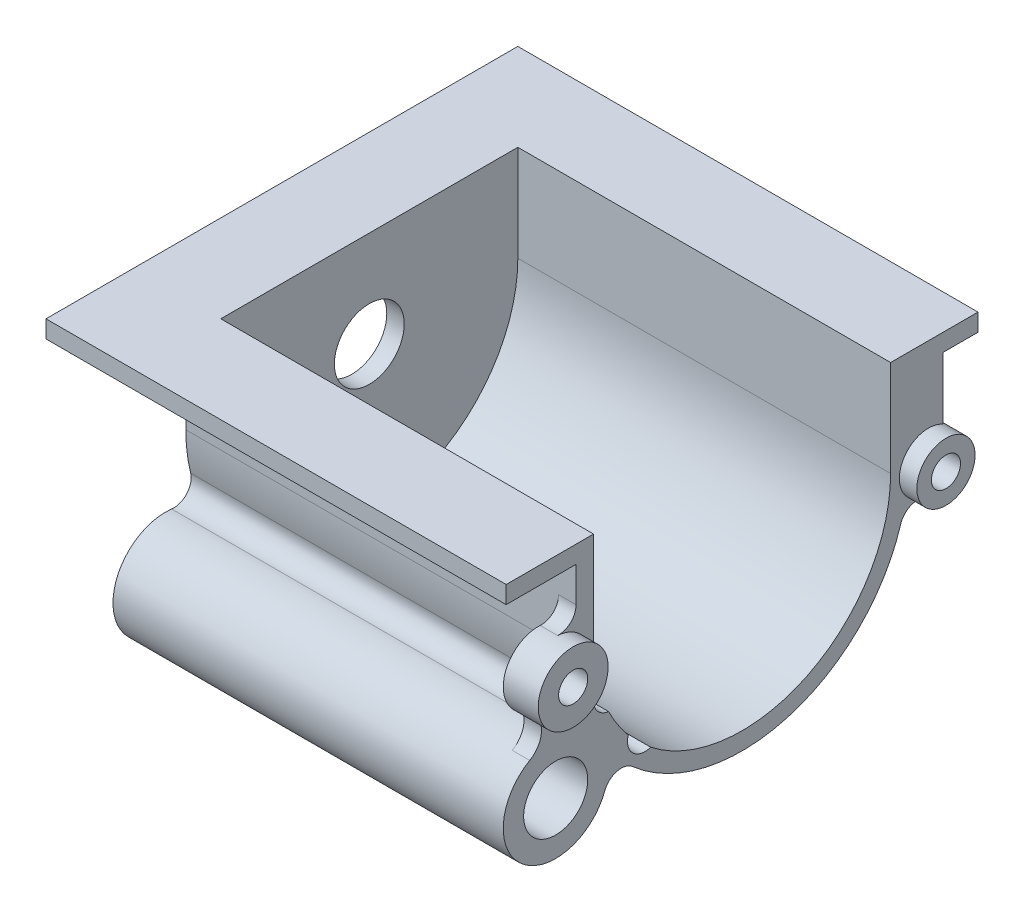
ISO-10303-21;
HEADER;
FILE_DESCRIPTION(('STEP AP214'),'2;1');
FILE_NAME('part.step','',(''),(''),'','','');
FILE_SCHEMA(('AUTOMOTIVE_DESIGN { 1 0 10303 214 1 1 1 1 }'));
ENDSEC;
DATA;
#1=APPLICATION_CONTEXT('core data for automotive mechanical design processes');
#2=APPLICATION_PROTOCOL_DEFINITION('international standard','automotive_design',2000,#1);
#3=PRODUCT_CONTEXT('',#1,'mechanical');
#4=PRODUCT('Part','Part','',(#3));
#5=PRODUCT_RELATED_PRODUCT_CATEGORY('part','',(#4));
#6=PRODUCT_DEFINITION_FORMATION('','',#4);
#7=PRODUCT_DEFINITION_CONTEXT('part definition',#1,'design');
#8=PRODUCT_DEFINITION('design','',#6,#7);
#9=PRODUCT_DEFINITION_SHAPE('','',#8);
#10=(LENGTH_UNIT() NAMED_UNIT(*) SI_UNIT(.MILLI.,.METRE.));
#11=(NAMED_UNIT(*) PLANE_ANGLE_UNIT() SI_UNIT($,.RADIAN.));
#12=(NAMED_UNIT(*) SI_UNIT($,.STERADIAN.) SOLID_ANGLE_UNIT());
#13=UNCERTAINTY_MEASURE_WITH_UNIT(LENGTH_MEASURE(1.E-05),#10,'distance_accuracy_value','');
#14=(GEOMETRIC_REPRESENTATION_CONTEXT(3) GLOBAL_UNCERTAINTY_ASSIGNED_CONTEXT((#13)) GLOBAL_UNIT_ASSIGNED_CONTEXT((#10,
#11,#12)) REPRESENTATION_CONTEXT('',''));
#15=CARTESIAN_POINT('',(0.,0.,0.));
#16=DIRECTION('',(0.,0.,1.));
#17=DIRECTION('',(1.,0.,0.));
#18=AXIS2_PLACEMENT_3D('',#15,#16,#17);
#19=CARTESIAN_POINT('',(67.,0.,0.));
#20=DIRECTION('',(-1.,0.,0.));
#21=DIRECTION('',(0.,0.,1.));
#22=AXIS2_PLACEMENT_3D('',#19,#20,#21);
#23=CYLINDRICAL_SURFACE('',#22,25.5);
#24=DIRECTION('',(1.,0.,0.));
#25=VECTOR('',#24,1.);
#26=CARTESIAN_POINT('',(35.,-16.3842544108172,19.5398620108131));
#27=LINE('',#26,#25);
#28=CARTESIAN_POINT('',(3.,-16.3842544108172,19.5398620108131));
#29=VERTEX_POINT('',#28);
#30=CARTESIAN_POINT('',(67.,-16.3842544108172,19.5398620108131));
#31=VERTEX_POINT('',#30);
#32=EDGE_CURVE('E213',#29,#31,#27,.T.);
#33=ORIENTED_EDGE('',*,*,#32,.F.);
#34=CARTESIAN_POINT('',(3.,0.,0.));
#35=DIRECTION('',(-1.,0.,0.));
#36=DIRECTION('',(0.,0.,1.));
#37=AXIS2_PLACEMENT_3D('',#34,#35,#36);
#38=CIRCLE('',#37,25.5);
#39=CARTESIAN_POINT('',(3.,-11.1864755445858,22.9153390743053));
#40=VERTEX_POINT('',#39);
#41=EDGE_CURVE('E394',#40,#29,#38,.F.);
#42=ORIENTED_EDGE('',*,*,#41,.F.);
#43=DIRECTION('',(1.,0.,0.));
#44=VECTOR('',#43,1.);
#45=CARTESIAN_POINT('',(35.,-11.1864755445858,22.9153390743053));
#46=LINE('',#45,#44);
#47=CARTESIAN_POINT('',(67.,-11.1864755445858,22.9153390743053));
#48=VERTEX_POINT('',#47);
#49=EDGE_CURVE('E232',#48,#40,#46,.F.);
#50=ORIENTED_EDGE('',*,*,#49,.F.);
#51=CARTESIAN_POINT('',(67.,0.,0.));
#52=DIRECTION('',(-1.,0.,0.));
#53=DIRECTION('',(0.,0.,1.));
#54=AXIS2_PLACEMENT_3D('',#51,#52,#53);
#55=CIRCLE('',#54,25.5);
#56=EDGE_CURVE('E227',#48,#31,#55,.F.);
#57=ORIENTED_EDGE('',*,*,#56,.T.);
#58=EDGE_LOOP('',(#33,#42,#50,#57));
#59=FACE_BOUND('',#58,.T.);
#60=ADVANCED_FACE('F28',(#59),#23,.F.);
#61=DIRECTION('',(1.,0.,0.));
#62=VECTOR('',#61,1.);
#63=CARTESIAN_POINT('',(35.,-6.1603585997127,24.7446960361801));
#64=LINE('',#63,#62);
#65=CARTESIAN_POINT('',(3.,-6.1603585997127,24.7446960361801));
#66=VERTEX_POINT('',#65);
#67=CARTESIAN_POINT('',(67.,-6.16035859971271,24.7446960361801));
#68=VERTEX_POINT('',#67);
#69=EDGE_CURVE('E420',#66,#68,#64,.T.);
#70=ORIENTED_EDGE('',*,*,#69,.F.);
#71=CARTESIAN_POINT('',(3.,0.,25.5));
#72=VERTEX_POINT('',#71);
#73=EDGE_CURVE('E391',#72,#66,#38,.F.);
#74=ORIENTED_EDGE('',*,*,#73,.F.);
#75=DIRECTION('',(-1.,0.,0.));
#76=VECTOR('',#75,1.);
#77=CARTESIAN_POINT('',(67.,0.,25.5));
#78=LINE('',#77,#76);
#79=CARTESIAN_POINT('',(67.,0.,25.5));
#80=VERTEX_POINT('',#79);
#81=EDGE_CURVE('E253',#80,#72,#78,.T.);
#82=ORIENTED_EDGE('',*,*,#81,.F.);
#83=EDGE_CURVE('E233',#80,#68,#55,.F.);
#84=ORIENTED_EDGE('',*,*,#83,.T.);
#85=EDGE_LOOP('',(#70,#74,#82,#84));
#86=FACE_BOUND('',#85,.T.);
#87=ADVANCED_FACE('F418',(#86),#23,.F.);
#88=CARTESIAN_POINT('',(67.,0.,0.));
#89=DIRECTION('',(-1.,0.,0.));
#90=DIRECTION('',(0.,0.,1.));
#91=AXIS2_PLACEMENT_3D('',#88,#89,#90);
#92=CYLINDRICAL_SURFACE('',#91,28.5);
#93=DIRECTION('',(-1.,0.,0.));
#94=VECTOR('',#93,1.);
#95=CARTESIAN_POINT('',(67.,-21.4374447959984,18.779935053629));
#96=LINE('',#95,#94);
#97=CARTESIAN_POINT('',(67.,-21.4374447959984,18.779935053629));
#98=VERTEX_POINT('',#97);
#99=CARTESIAN_POINT('',(0.,-21.4374447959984,18.779935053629));
#100=VERTEX_POINT('',#99);
#101=EDGE_CURVE('E290',#98,#100,#96,.T.);
#102=ORIENTED_EDGE('',*,*,#101,.T.);
#103=CARTESIAN_POINT('',(0.,0.,0.));
#104=DIRECTION('',(1.,0.,0.));
#105=DIRECTION('',(0.,0.,1.));
#106=AXIS2_PLACEMENT_3D('',#103,#104,#105);
#107=CIRCLE('',#106,28.5);
#108=CARTESIAN_POINT('',(0.,0.,-28.5));
#109=VERTEX_POINT('',#108);
#110=EDGE_CURVE('E258',#100,#109,#107,.T.);
#111=ORIENTED_EDGE('',*,*,#110,.T.);
#112=DIRECTION('',(-1.,0.,0.));
#113=VECTOR('',#112,1.);
#114=CARTESIAN_POINT('',(67.,0.,-28.5));
#115=LINE('',#114,#113);
#116=CARTESIAN_POINT('',(64.,0.,-28.5));
#117=VERTEX_POINT('',#116);
#118=EDGE_CURVE('E276',#117,#109,#115,.T.);
#119=ORIENTED_EDGE('',*,*,#118,.F.);
#120=CARTESIAN_POINT('',(64.,0.,0.));
#121=DIRECTION('',(1.,0.,0.));
#122=DIRECTION('',(0.,0.,-1.));
#123=AXIS2_PLACEMENT_3D('',#120,#121,#122);
#124=CIRCLE('',#123,28.5);
#125=CARTESIAN_POINT('',(64.,-8.38911689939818,-27.2373405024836));
#126=VERTEX_POINT('',#125);
#127=EDGE_CURVE('E319',#126,#117,#124,.T.);
#128=ORIENTED_EDGE('',*,*,#127,.F.);
#129=DIRECTION('',(-1.,0.,0.));
#130=VECTOR('',#129,1.);
#131=CARTESIAN_POINT('',(67.,-8.38911689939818,-27.2373405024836));
#132=LINE('',#131,#130);
#133=CARTESIAN_POINT('',(67.,-8.38911689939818,-27.2373405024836));
#134=VERTEX_POINT('',#133);
#135=EDGE_CURVE('E287',#126,#134,#132,.F.);
#136=ORIENTED_EDGE('',*,*,#135,.T.);
#137=CARTESIAN_POINT('',(67.,0.,0.));
#138=DIRECTION('',(1.,0.,0.));
#139=DIRECTION('',(0.,0.,1.));
#140=AXIS2_PLACEMENT_3D('',#137,#138,#139);
#141=CIRCLE('',#140,28.5);
#142=EDGE_CURVE('E264',#98,#134,#141,.T.);
#143=ORIENTED_EDGE('',*,*,#142,.F.);
#144=EDGE_LOOP('',(#102,#111,#119,#128,#136,#143));
#145=FACE_BOUND('',#144,.T.);
#146=ADVANCED_FACE('F480',(#145),#92,.T.);
#147=CARTESIAN_POINT('',(64.,0.,0.));
#148=DIRECTION('',(1.,0.,0.));
#149=DIRECTION('',(0.,0.,-1.));
#150=AXIS2_PLACEMENT_3D('',#147,#148,#149);
#151=PLANE('',#150);
#152=CARTESIAN_POINT('',(64.,-1.5,32.));
#153=DIRECTION('',(1.,0.,0.));
#154=DIRECTION('',(0.,0.,-1.));
#155=AXIS2_PLACEMENT_3D('',#152,#153,#154);
#156=CIRCLE('',#155,2.49999999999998);
#157=CARTESIAN_POINT('',(64.,-1.5,29.5));
#158=VERTEX_POINT('',#157);
#159=EDGE_CURVE('E499',#158,#158,#156,.T.);
#160=ORIENTED_EDGE('',*,*,#159,.T.);
#161=EDGE_LOOP('',(#160));
#162=FACE_BOUND('',#161,.T.);
#163=CARTESIAN_POINT('',(64.,-19.5,32.));
#164=DIRECTION('',(-1.,0.,0.));
#165=DIRECTION('',(0.,0.,1.));
#166=AXIS2_PLACEMENT_3D('',#163,#164,#165);
#167=CIRCLE('',#166,9.);
#168=CARTESIAN_POINT('',(64.,-11.682796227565,36.4599691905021));
#169=VERTEX_POINT('',#168);
#170=CARTESIAN_POINT('',(64.,-10.5638509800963,30.9298408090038));
#171=VERTEX_POINT('',#170);
#172=EDGE_CURVE('E428',#169,#171,#167,.T.);
#173=ORIENTED_EDGE('',*,*,#172,.F.);
#174=CARTESIAN_POINT('',(64.,-8.20848343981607,38.4421777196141));
#175=DIRECTION('',(-1.,0.,0.));
#176=DIRECTION('',(0.,0.,-1.));
#177=AXIS2_PLACEMENT_3D('',#174,#175,#176);
#178=CIRCLE('',#177,4.);
#179=CARTESIAN_POINT('',(64.,-6.8721953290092,34.6719875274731));
#180=VERTEX_POINT('',#179);
#181=EDGE_CURVE('E342',#180,#169,#178,.T.);
#182=ORIENTED_EDGE('',*,*,#181,.F.);
#183=CARTESIAN_POINT('',(64.,-1.5,32.));
#184=DIRECTION('',(1.,0.,0.));
#185=DIRECTION('',(0.,0.,-1.));
#186=AXIS2_PLACEMENT_3D('',#183,#184,#185);
#187=CIRCLE('',#186,6.);
#188=CARTESIAN_POINT('',(64.,4.49073358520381,31.6666666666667));
#189=VERTEX_POINT('',#188);
#190=EDGE_CURVE('E340',#189,#180,#187,.T.);
#191=ORIENTED_EDGE('',*,*,#190,.F.);
#192=CARTESIAN_POINT('',(64.,7.48610037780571,31.5));
#193=DIRECTION('',(1.,0.,0.));
#194=DIRECTION('',(0.,0.,-1.));
#195=AXIS2_PLACEMENT_3D('',#192,#193,#194);
#196=CIRCLE('',#195,3.);
#197=CARTESIAN_POINT('',(64.,7.48610037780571,28.5));
#198=VERTEX_POINT('',#197);
#199=EDGE_CURVE('E295',#189,#198,#196,.T.);
#200=ORIENTED_EDGE('',*,*,#199,.T.);
#201=DIRECTION('',(0.,1.,0.));
#202=VECTOR('',#201,1.);
#203=CARTESIAN_POINT('',(64.,3.37339717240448,28.5));
#204=LINE('',#203,#202);
#205=CARTESIAN_POINT('',(64.,0.,28.5));
#206=VERTEX_POINT('',#205);
#207=EDGE_CURVE('E338',#206,#198,#204,.T.);
#208=ORIENTED_EDGE('',*,*,#207,.F.);
#209=CARTESIAN_POINT('',(64.,0.,0.));
#210=DIRECTION('',(-1.,0.,0.));
#211=DIRECTION('',(0.,0.,-1.));
#212=AXIS2_PLACEMENT_3D('',#209,#210,#211);
#213=CIRCLE('',#212,28.5);
#214=CARTESIAN_POINT('',(64.,-6.86274086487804,27.6613952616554));
#215=VERTEX_POINT('',#214);
#216=EDGE_CURVE('E336',#215,#206,#213,.T.);
#217=ORIENTED_EDGE('',*,*,#216,.F.);
#218=CARTESIAN_POINT('',(64.,-7.58513464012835,30.5731210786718));
#219=DIRECTION('',(1.,0.,0.));
#220=DIRECTION('',(0.,0.,-1.));
#221=AXIS2_PLACEMENT_3D('',#218,#219,#220);
#222=CIRCLE('',#221,3.00000000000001);
#223=EDGE_CURVE('E429',#171,#215,#222,.T.);
#224=ORIENTED_EDGE('',*,*,#223,.F.);
#225=EDGE_LOOP('',(#173,#182,#191,#200,#208,#217,#224));
#226=FACE_BOUND('',#225,.T.);
#227=ADVANCED_FACE('F537',(#162,#226),#151,.F.);
#228=CARTESIAN_POINT('',(67.,0.,0.));
#229=DIRECTION('',(-1.,0.,0.));
#230=DIRECTION('',(0.,0.,1.));
#231=AXIS2_PLACEMENT_3D('',#228,#229,#230);
#232=PLANE('',#231);
#233=CARTESIAN_POINT('',(67.,-19.5,32.));
#234=DIRECTION('',(1.,0.,0.));
#235=DIRECTION('',(0.,0.,-1.));
#236=AXIS2_PLACEMENT_3D('',#233,#234,#235);
#237=CIRCLE('',#236,5.49999999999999);
#238=CARTESIAN_POINT('',(67.,-19.5,26.5));
#239=VERTEX_POINT('',#238);
#240=EDGE_CURVE('E505',#239,#239,#237,.T.);
#241=ORIENTED_EDGE('',*,*,#240,.F.);
#242=EDGE_LOOP('',(#241));
#243=FACE_BOUND('',#242,.T.);
#244=CARTESIAN_POINT('',(67.,-20.0997610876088,15.6923422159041));
#245=VERTEX_POINT('',#244);
#246=CARTESIAN_POINT('',(67.,0.,-25.5));
#247=VERTEX_POINT('',#246);
#248=EDGE_CURVE('E229',#245,#247,#55,.F.);
#249=ORIENTED_EDGE('',*,*,#248,.F.);
#250=CARTESIAN_POINT('',(67.,-17.2641552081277,16.6718008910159));
#251=DIRECTION('',(1.,0.,0.));
#252=DIRECTION('',(0.,0.,-1.));
#253=AXIS2_PLACEMENT_3D('',#250,#251,#252);
#254=CIRCLE('',#253,3.);
#255=EDGE_CURVE('E45',#31,#245,#254,.T.);
#256=ORIENTED_EDGE('',*,*,#255,.F.);
#257=ORIENTED_EDGE('',*,*,#56,.F.);
#258=CARTESIAN_POINT('',(67.,-8.20848343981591,22.5526228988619));
#259=DIRECTION('',(1.,0.,0.));
#260=DIRECTION('',(0.,0.,-1.));
#261=AXIS2_PLACEMENT_3D('',#258,#259,#260);
#262=CIRCLE('',#261,3.);
#263=EDGE_CURVE('E53',#68,#48,#262,.T.);
#264=ORIENTED_EDGE('',*,*,#263,.F.);
#265=ORIENTED_EDGE('',*,*,#83,.F.);
#266=DIRECTION('',(0.,-1.,0.));
#267=VECTOR('',#266,1.);
#268=CARTESIAN_POINT('',(67.,0.,25.5));
#269=LINE('',#268,#267);
#270=CARTESIAN_POINT('',(67.,16.5,25.5));
#271=VERTEX_POINT('',#270);
#272=EDGE_CURVE('E242',#271,#80,#269,.T.);
#273=ORIENTED_EDGE('',*,*,#272,.F.);
#274=DIRECTION('',(0.,0.,1.));
#275=VECTOR('',#274,1.);
#276=CARTESIAN_POINT('',(67.,16.5,28.5));
#277=LINE('',#276,#275);
#278=CARTESIAN_POINT('',(67.,16.5,40.5));
#279=VERTEX_POINT('',#278);
#280=EDGE_CURVE('E267',#271,#279,#277,.T.);
#281=ORIENTED_EDGE('',*,*,#280,.T.);
#282=DIRECTION('',(0.,1.,0.));
#283=VECTOR('',#282,1.);
#284=CARTESIAN_POINT('',(67.,13.5,40.5));
#285=LINE('',#284,#283);
#286=CARTESIAN_POINT('',(67.,13.5,40.5));
#287=VERTEX_POINT('',#286);
#288=EDGE_CURVE('E374',#287,#279,#285,.T.);
#289=ORIENTED_EDGE('',*,*,#288,.F.);
#290=DIRECTION('',(0.,0.,-1.));
#291=VECTOR('',#290,1.);
#292=CARTESIAN_POINT('',(67.,13.5,25.5));
#293=LINE('',#292,#291);
#294=CARTESIAN_POINT('',(67.,13.5,28.5));
#295=VERTEX_POINT('',#294);
#296=EDGE_CURVE('E370',#287,#295,#293,.T.);
#297=ORIENTED_EDGE('',*,*,#296,.T.);
#298=DIRECTION('',(0.,-1.,0.));
#299=VECTOR('',#298,1.);
#300=CARTESIAN_POINT('',(67.,0.,28.5));
#301=LINE('',#300,#299);
#302=CARTESIAN_POINT('',(67.,7.48610037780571,28.5));
#303=VERTEX_POINT('',#302);
#304=EDGE_CURVE('E271',#295,#303,#301,.T.);
#305=ORIENTED_EDGE('',*,*,#304,.T.);
#306=CARTESIAN_POINT('',(67.,7.48610037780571,31.5));
#307=DIRECTION('',(-1.,0.,0.));
#308=DIRECTION('',(0.,0.,1.));
#309=AXIS2_PLACEMENT_3D('',#306,#307,#308);
#310=CIRCLE('',#309,3.);
#311=CARTESIAN_POINT('',(67.,4.49073358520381,31.6666666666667));
#312=VERTEX_POINT('',#311);
#313=EDGE_CURVE('E293',#303,#312,#310,.T.);
#314=ORIENTED_EDGE('',*,*,#313,.T.);
#315=CARTESIAN_POINT('',(67.,-1.5,32.));
#316=DIRECTION('',(1.,0.,0.));
#317=DIRECTION('',(0.,0.,-1.));
#318=AXIS2_PLACEMENT_3D('',#315,#316,#317);
#319=CIRCLE('',#318,5.99999999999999);
#320=CARTESIAN_POINT('',(67.,-6.8721953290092,34.6719875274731));
#321=VERTEX_POINT('',#320);
#322=EDGE_CURVE('E439',#321,#312,#319,.T.);
#323=ORIENTED_EDGE('',*,*,#322,.F.);
#324=CARTESIAN_POINT('',(67.,-8.20848343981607,38.4421777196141));
#325=DIRECTION('',(-1.,0.,0.));
#326=DIRECTION('',(0.,0.,-1.));
#327=AXIS2_PLACEMENT_3D('',#324,#325,#326);
#328=CIRCLE('',#327,4.);
#329=CARTESIAN_POINT('',(67.,-11.682796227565,36.4599691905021));
#330=VERTEX_POINT('',#329);
#331=EDGE_CURVE('E330',#321,#330,#328,.T.);
#332=ORIENTED_EDGE('',*,*,#331,.T.);
#333=CARTESIAN_POINT('',(67.,-19.5,32.));
#334=DIRECTION('',(1.,0.,0.));
#335=DIRECTION('',(0.,0.,-1.));
#336=AXIS2_PLACEMENT_3D('',#333,#334,#335);
#337=CIRCLE('',#336,9.);
#338=CARTESIAN_POINT('',(67.,-22.6455134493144,23.567577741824));
#339=VERTEX_POINT('',#338);
#340=EDGE_CURVE('E333',#330,#339,#337,.T.);
#341=ORIENTED_EDGE('',*,*,#340,.T.);
#342=CARTESIAN_POINT('',(67.,-23.6940179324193,20.756770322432));
#343=DIRECTION('',(-1.,0.,0.));
#344=DIRECTION('',(0.,0.,1.));
#345=AXIS2_PLACEMENT_3D('',#342,#343,#344);
#346=CIRCLE('',#345,3.);
#347=EDGE_CURVE('E298',#339,#98,#346,.T.);
#348=ORIENTED_EDGE('',*,*,#347,.T.);
#349=ORIENTED_EDGE('',*,*,#142,.T.);
#350=CARTESIAN_POINT('',(67.,-9.27218183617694,-30.1044289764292));
#351=DIRECTION('',(-1.,0.,0.));
#352=DIRECTION('',(0.,0.,1.));
#353=AXIS2_PLACEMENT_3D('',#350,#351,#352);
#354=CIRCLE('',#353,3.);
#355=CARTESIAN_POINT('',(67.,-6.35761364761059,-30.8152681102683));
#356=VERTEX_POINT('',#355);
#357=EDGE_CURVE('E37',#134,#356,#354,.T.);
#358=ORIENTED_EDGE('',*,*,#357,.T.);
#359=CARTESIAN_POINT('',(67.,-1.5,-32.));
#360=DIRECTION('',(1.,0.,0.));
#361=DIRECTION('',(0.,0.,-1.));
#362=AXIS2_PLACEMENT_3D('',#359,#360,#361);
#363=CIRCLE('',#362,5.);
#364=CARTESIAN_POINT('',(67.,2.83012701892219,-34.5));
#365=VERTEX_POINT('',#364);
#366=EDGE_CURVE('E305',#365,#356,#363,.T.);
#367=ORIENTED_EDGE('',*,*,#366,.F.);
#368=DIRECTION('',(0.,1.,0.));
#369=VECTOR('',#368,1.);
#370=CARTESIAN_POINT('',(67.,2.83012701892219,-34.5));
#371=LINE('',#370,#369);
#372=CARTESIAN_POINT('',(67.,13.5,-34.5));
#373=VERTEX_POINT('',#372);
#374=EDGE_CURVE('E302',#365,#373,#371,.T.);
#375=ORIENTED_EDGE('',*,*,#374,.T.);
#376=DIRECTION('',(0.,0.,-1.));
#377=VECTOR('',#376,1.);
#378=CARTESIAN_POINT('',(67.,13.5,-25.5));
#379=LINE('',#378,#377);
#380=CARTESIAN_POINT('',(67.,13.5,-40.5));
#381=VERTEX_POINT('',#380);
#382=EDGE_CURVE('E359',#373,#381,#379,.T.);
#383=ORIENTED_EDGE('',*,*,#382,.T.);
#384=DIRECTION('',(0.,1.,0.));
#385=VECTOR('',#384,1.);
#386=CARTESIAN_POINT('',(67.,13.5,-40.5));
#387=LINE('',#386,#385);
#388=CARTESIAN_POINT('',(67.,16.5,-40.5));
#389=VERTEX_POINT('',#388);
#390=EDGE_CURVE('E373',#381,#389,#387,.T.);
#391=ORIENTED_EDGE('',*,*,#390,.T.);
#392=CARTESIAN_POINT('',(67.,16.5,-25.5));
#393=VERTEX_POINT('',#392);
#394=EDGE_CURVE('E268',#389,#393,#277,.T.);
#395=ORIENTED_EDGE('',*,*,#394,.T.);
#396=DIRECTION('',(0.,1.,0.));
#397=VECTOR('',#396,1.);
#398=CARTESIAN_POINT('',(67.,0.,-25.5));
#399=LINE('',#398,#397);
#400=EDGE_CURVE('E236',#247,#393,#399,.T.);
#401=ORIENTED_EDGE('',*,*,#400,.F.);
#402=EDGE_LOOP('',(#249,#256,#257,#264,#265,#273,#281,#289,#297,#305,#314,#323,#332,#341,#348,
#349,#358,#367,#375,#383,#391,#395,#401));
#403=FACE_BOUND('',#402,.T.);
#404=ADVANCED_FACE('F226',(#243,#403),#232,.F.);
#405=CARTESIAN_POINT('',(67.,0.,-28.5));
#406=DIRECTION('',(0.,0.,1.));
#407=DIRECTION('',(1.,0.,0.));
#408=AXIS2_PLACEMENT_3D('',#405,#406,#407);
#409=PLANE('',#408);
#410=DIRECTION('',(0.,1.,0.));
#411=VECTOR('',#410,1.);
#412=CARTESIAN_POINT('',(64.,0.,-28.5));
#413=LINE('',#412,#411);
#414=CARTESIAN_POINT('',(64.,13.5,-28.5));
#415=VERTEX_POINT('',#414);
#416=EDGE_CURVE('E315',#117,#415,#413,.T.);
#417=ORIENTED_EDGE('',*,*,#416,.F.);
#418=ORIENTED_EDGE('',*,*,#118,.T.);
#419=DIRECTION('',(0.,1.,0.));
#420=VECTOR('',#419,1.);
#421=CARTESIAN_POINT('',(0.,0.,-28.5));
#422=LINE('',#421,#420);
#423=CARTESIAN_POINT('',(0.,13.5,-28.5));
#424=VERTEX_POINT('',#423);
#425=EDGE_CURVE('E257',#109,#424,#422,.T.);
#426=ORIENTED_EDGE('',*,*,#425,.T.);
#427=DIRECTION('',(-1.,0.,0.));
#428=VECTOR('',#427,1.);
#429=CARTESIAN_POINT('',(67.,13.5,-28.5));
#430=LINE('',#429,#428);
#431=EDGE_CURVE('E388',#415,#424,#430,.T.);
#432=ORIENTED_EDGE('',*,*,#431,.F.);
#433=EDGE_LOOP('',(#417,#418,#426,#432));
#434=FACE_BOUND('',#433,.T.);
#435=ADVANCED_FACE('F536',(#434),#409,.F.);
#436=CARTESIAN_POINT('',(67.,0.,28.5));
#437=DIRECTION('',(0.,0.,-1.));
#438=DIRECTION('',(-1.,0.,0.));
#439=AXIS2_PLACEMENT_3D('',#436,#437,#438);
#440=PLANE('',#439);
#441=ORIENTED_EDGE('',*,*,#207,.T.);
#442=DIRECTION('',(1.,0.,0.));
#443=VECTOR('',#442,1.);
#444=CARTESIAN_POINT('',(67.,7.48610037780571,28.5));
#445=LINE('',#444,#443);
#446=EDGE_CURVE('E279',#198,#303,#445,.T.);
#447=ORIENTED_EDGE('',*,*,#446,.T.);
#448=ORIENTED_EDGE('',*,*,#304,.F.);
#449=DIRECTION('',(1.,0.,0.));
#450=VECTOR('',#449,1.);
#451=CARTESIAN_POINT('',(67.,13.5,28.5));
#452=LINE('',#451,#450);
#453=CARTESIAN_POINT('',(0.,13.5,28.5));
#454=VERTEX_POINT('',#453);
#455=EDGE_CURVE('E386',#454,#295,#452,.T.);
#456=ORIENTED_EDGE('',*,*,#455,.F.);
#457=DIRECTION('',(0.,-1.,0.));
#458=VECTOR('',#457,1.);
#459=CARTESIAN_POINT('',(0.,0.,28.5));
#460=LINE('',#459,#458);
#461=CARTESIAN_POINT('',(0.,0.,28.5));
#462=VERTEX_POINT('',#461);
#463=EDGE_CURVE('E261',#454,#462,#460,.T.);
#464=ORIENTED_EDGE('',*,*,#463,.T.);
#465=DIRECTION('',(-1.,0.,0.));
#466=VECTOR('',#465,1.);
#467=CARTESIAN_POINT('',(67.,0.,28.5));
#468=LINE('',#467,#466);
#469=EDGE_CURVE('E274',#206,#462,#468,.T.);
#470=ORIENTED_EDGE('',*,*,#469,.F.);
#471=EDGE_LOOP('',(#441,#447,#448,#456,#464,#470));
#472=FACE_BOUND('',#471,.T.);
#473=ADVANCED_FACE('F532',(#472),#440,.F.);
#474=CARTESIAN_POINT('',(0.,0.,0.));
#475=DIRECTION('',(-1.,0.,0.));
#476=DIRECTION('',(0.,0.,1.));
#477=AXIS2_PLACEMENT_3D('',#474,#475,#476);
#478=PLANE('',#477);
#479=CARTESIAN_POINT('',(0.,0.,0.));
#480=DIRECTION('',(-1.,0.,0.));
#481=DIRECTION('',(0.,0.,1.));
#482=AXIS2_PLACEMENT_3D('',#479,#480,#481);
#483=CIRCLE('',#482,5.99999999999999);
#484=CARTESIAN_POINT('',(0.,0.,5.99999999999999));
#485=VERTEX_POINT('',#484);
#486=EDGE_CURVE('E508',#485,#485,#483,.T.);
#487=ORIENTED_EDGE('',*,*,#486,.F.);
#488=EDGE_LOOP('',(#487));
#489=FACE_BOUND('',#488,.T.);
#490=CARTESIAN_POINT('',(0.,-19.5,32.));
#491=DIRECTION('',(-1.,0.,0.));
#492=DIRECTION('',(0.,0.,1.));
#493=AXIS2_PLACEMENT_3D('',#490,#491,#492);
#494=CIRCLE('',#493,5.49999999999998);
#495=CARTESIAN_POINT('',(0.,-19.5,37.5));
#496=VERTEX_POINT('',#495);
#497=EDGE_CURVE('E32',#496,#496,#494,.T.);
#498=ORIENTED_EDGE('',*,*,#497,.F.);
#499=EDGE_LOOP('',(#498));
#500=FACE_BOUND('',#499,.T.);
#501=ORIENTED_EDGE('',*,*,#463,.F.);
#502=DIRECTION('',(0.,0.,-1.));
#503=VECTOR('',#502,1.);
#504=CARTESIAN_POINT('',(0.,13.5,0.));
#505=LINE('',#504,#503);
#506=EDGE_CURVE('E377',#454,#424,#505,.T.);
#507=ORIENTED_EDGE('',*,*,#506,.T.);
#508=ORIENTED_EDGE('',*,*,#425,.F.);
#509=ORIENTED_EDGE('',*,*,#110,.F.);
#510=CARTESIAN_POINT('',(0.,-23.6940179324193,20.756770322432));
#511=DIRECTION('',(-1.,0.,0.));
#512=DIRECTION('',(0.,0.,1.));
#513=AXIS2_PLACEMENT_3D('',#510,#511,#512);
#514=CIRCLE('',#513,3.);
#515=CARTESIAN_POINT('',(0.,-22.6455134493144,23.567577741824));
#516=VERTEX_POINT('',#515);
#517=EDGE_CURVE('E443',#100,#516,#514,.F.);
#518=ORIENTED_EDGE('',*,*,#517,.T.);
#519=CARTESIAN_POINT('',(0.,-19.5,32.));
#520=DIRECTION('',(-1.,0.,0.));
#521=DIRECTION('',(0.,0.,1.));
#522=AXIS2_PLACEMENT_3D('',#519,#520,#521);
#523=CIRCLE('',#522,9.);
#524=CARTESIAN_POINT('',(0.,-10.5638509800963,30.9298408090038));
#525=VERTEX_POINT('',#524);
#526=EDGE_CURVE('E440',#516,#525,#523,.T.);
#527=ORIENTED_EDGE('',*,*,#526,.T.);
#528=CARTESIAN_POINT('',(0.,-7.58513464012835,30.5731210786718));
#529=DIRECTION('',(-1.,0.,0.));
#530=DIRECTION('',(0.,0.,1.));
#531=AXIS2_PLACEMENT_3D('',#528,#529,#530);
#532=CIRCLE('',#531,3.00000000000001);
#533=CARTESIAN_POINT('',(0.,-6.86274086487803,27.6613952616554));
#534=VERTEX_POINT('',#533);
#535=EDGE_CURVE('E436',#525,#534,#532,.F.);
#536=ORIENTED_EDGE('',*,*,#535,.T.);
#537=EDGE_CURVE('E255',#462,#534,#107,.T.);
#538=ORIENTED_EDGE('',*,*,#537,.F.);
#539=EDGE_LOOP('',(#501,#507,#508,#509,#518,#527,#536,#538));
#540=FACE_BOUND('',#539,.T.);
#541=ADVANCED_FACE('F530',(#489,#500,#540),#478,.T.);
#542=ORIENTED_EDGE('',*,*,#537,.T.);
#543=DIRECTION('',(1.,0.,0.));
#544=VECTOR('',#543,1.);
#545=CARTESIAN_POINT('',(-31.0145493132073,-6.86274086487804,27.6613952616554));
#546=LINE('',#545,#544);
#547=EDGE_CURVE('E432',#534,#215,#546,.T.);
#548=ORIENTED_EDGE('',*,*,#547,.T.);
#549=ORIENTED_EDGE('',*,*,#216,.T.);
#550=ORIENTED_EDGE('',*,*,#469,.T.);
#551=EDGE_LOOP('',(#542,#548,#549,#550));
#552=FACE_BOUND('',#551,.T.);
#553=ADVANCED_FACE('F30',(#552),#92,.T.);
#554=CARTESIAN_POINT('',(67.,16.5,28.5));
#555=DIRECTION('',(0.,-1.,0.));
#556=DIRECTION('',(0.,0.,-1.));
#557=AXIS2_PLACEMENT_3D('',#554,#555,#556);
#558=PLANE('',#557);
#559=ORIENTED_EDGE('',*,*,#280,.F.);
#560=DIRECTION('',(-1.,0.,0.));
#561=VECTOR('',#560,1.);
#562=CARTESIAN_POINT('',(67.,16.5,25.5));
#563=LINE('',#562,#561);
#564=CARTESIAN_POINT('',(3.,16.5,25.5));
#565=VERTEX_POINT('',#564);
#566=EDGE_CURVE('E247',#271,#565,#563,.T.);
#567=ORIENTED_EDGE('',*,*,#566,.T.);
#568=DIRECTION('',(0.,0.,1.));
#569=VECTOR('',#568,1.);
#570=CARTESIAN_POINT('',(3.,16.5,0.));
#571=LINE('',#570,#569);
#572=CARTESIAN_POINT('',(3.,16.5,-25.5));
#573=VERTEX_POINT('',#572);
#574=EDGE_CURVE('E248',#573,#565,#571,.T.);
#575=ORIENTED_EDGE('',*,*,#574,.F.);
#576=DIRECTION('',(-1.,0.,0.));
#577=VECTOR('',#576,1.);
#578=CARTESIAN_POINT('',(67.,16.5,-25.5));
#579=LINE('',#578,#577);
#580=EDGE_CURVE('E243',#393,#573,#579,.T.);
#581=ORIENTED_EDGE('',*,*,#580,.F.);
#582=ORIENTED_EDGE('',*,*,#394,.F.);
#583=DIRECTION('',(-1.,0.,0.));
#584=VECTOR('',#583,1.);
#585=CARTESIAN_POINT('',(67.,16.5,-40.5));
#586=LINE('',#585,#584);
#587=CARTESIAN_POINT('',(-12.,16.5,-40.5));
#588=VERTEX_POINT('',#587);
#589=EDGE_CURVE('E348',#389,#588,#586,.T.);
#590=ORIENTED_EDGE('',*,*,#589,.T.);
#591=DIRECTION('',(0.,0.,1.));
#592=VECTOR('',#591,1.);
#593=CARTESIAN_POINT('',(-12.,16.5,-40.5));
#594=LINE('',#593,#592);
#595=CARTESIAN_POINT('',(-12.,16.5,40.5));
#596=VERTEX_POINT('',#595);
#597=EDGE_CURVE('E353',#588,#596,#594,.T.);
#598=ORIENTED_EDGE('',*,*,#597,.T.);
#599=DIRECTION('',(1.,0.,0.));
#600=VECTOR('',#599,1.);
#601=CARTESIAN_POINT('',(-12.,16.5,40.5));
#602=LINE('',#601,#600);
#603=EDGE_CURVE('E356',#596,#279,#602,.T.);
#604=ORIENTED_EDGE('',*,*,#603,.T.);
#605=EDGE_LOOP('',(#559,#567,#575,#581,#582,#590,#598,#604));
#606=FACE_BOUND('',#605,.T.);
#607=ADVANCED_FACE('F410',(#606),#558,.F.);
#608=DIRECTION('',(1.,0.,0.));
#609=VECTOR('',#608,1.);
#610=CARTESIAN_POINT('',(35.,-20.0997610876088,15.6923422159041));
#611=LINE('',#610,#609);
#612=CARTESIAN_POINT('',(3.,-20.0997610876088,15.6923422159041));
#613=VERTEX_POINT('',#612);
#614=EDGE_CURVE('E221',#245,#613,#611,.F.);
#615=ORIENTED_EDGE('',*,*,#614,.F.);
#616=ORIENTED_EDGE('',*,*,#248,.T.);
#617=DIRECTION('',(1.,0.,0.));
#618=VECTOR('',#617,1.);
#619=CARTESIAN_POINT('',(67.,0.,-25.5));
#620=LINE('',#619,#618);
#621=CARTESIAN_POINT('',(3.,0.,-25.5));
#622=VERTEX_POINT('',#621);
#623=EDGE_CURVE('E246',#247,#622,#620,.F.);
#624=ORIENTED_EDGE('',*,*,#623,.T.);
#625=EDGE_CURVE('E390',#613,#622,#38,.F.);
#626=ORIENTED_EDGE('',*,*,#625,.F.);
#627=EDGE_LOOP('',(#615,#616,#624,#626));
#628=FACE_BOUND('',#627,.T.);
#629=ADVANCED_FACE('F475',(#628),#23,.F.);
#630=CARTESIAN_POINT('',(67.,0.,-25.5));
#631=DIRECTION('',(0.,0.,1.));
#632=DIRECTION('',(1.,0.,0.));
#633=AXIS2_PLACEMENT_3D('',#630,#631,#632);
#634=PLANE('',#633);
#635=ORIENTED_EDGE('',*,*,#580,.T.);
#636=DIRECTION('',(0.,1.,0.));
#637=VECTOR('',#636,1.);
#638=CARTESIAN_POINT('',(3.,0.,-25.5));
#639=LINE('',#638,#637);
#640=EDGE_CURVE('E250',#622,#573,#639,.T.);
#641=ORIENTED_EDGE('',*,*,#640,.F.);
#642=ORIENTED_EDGE('',*,*,#623,.F.);
#643=ORIENTED_EDGE('',*,*,#400,.T.);
#644=EDGE_LOOP('',(#635,#641,#642,#643));
#645=FACE_BOUND('',#644,.T.);
#646=ADVANCED_FACE('F407',(#645),#634,.T.);
#647=CARTESIAN_POINT('',(67.,0.,25.5));
#648=DIRECTION('',(0.,0.,-1.));
#649=DIRECTION('',(-1.,0.,0.));
#650=AXIS2_PLACEMENT_3D('',#647,#648,#649);
#651=PLANE('',#650);
#652=ORIENTED_EDGE('',*,*,#272,.T.);
#653=ORIENTED_EDGE('',*,*,#81,.T.);
#654=DIRECTION('',(0.,-1.,0.));
#655=VECTOR('',#654,1.);
#656=CARTESIAN_POINT('',(3.,0.,25.5));
#657=LINE('',#656,#655);
#658=EDGE_CURVE('E237',#565,#72,#657,.T.);
#659=ORIENTED_EDGE('',*,*,#658,.F.);
#660=ORIENTED_EDGE('',*,*,#566,.F.);
#661=EDGE_LOOP('',(#652,#653,#659,#660));
#662=FACE_BOUND('',#661,.T.);
#663=ADVANCED_FACE('F413',(#662),#651,.T.);
#664=CARTESIAN_POINT('',(3.,0.,0.));
#665=DIRECTION('',(-1.,0.,0.));
#666=DIRECTION('',(0.,0.,1.));
#667=AXIS2_PLACEMENT_3D('',#664,#665,#666);
#668=PLANE('',#667);
#669=CARTESIAN_POINT('',(3.,0.,0.));
#670=DIRECTION('',(1.,0.,0.));
#671=DIRECTION('',(0.,0.,-1.));
#672=AXIS2_PLACEMENT_3D('',#669,#670,#671);
#673=CIRCLE('',#672,5.99999999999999);
#674=CARTESIAN_POINT('',(3.,0.,-5.99999999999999));
#675=VERTEX_POINT('',#674);
#676=EDGE_CURVE('E511',#675,#675,#673,.T.);
#677=ORIENTED_EDGE('',*,*,#676,.F.);
#678=EDGE_LOOP('',(#677));
#679=FACE_BOUND('',#678,.T.);
#680=ORIENTED_EDGE('',*,*,#41,.T.);
#681=CARTESIAN_POINT('',(3.,-17.2641552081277,16.6718008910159));
#682=DIRECTION('',(-1.,0.,0.));
#683=DIRECTION('',(0.,0.,1.));
#684=AXIS2_PLACEMENT_3D('',#681,#682,#683);
#685=CIRCLE('',#684,3.);
#686=EDGE_CURVE('E216',#29,#613,#685,.F.);
#687=ORIENTED_EDGE('',*,*,#686,.T.);
#688=ORIENTED_EDGE('',*,*,#625,.T.);
#689=ORIENTED_EDGE('',*,*,#640,.T.);
#690=ORIENTED_EDGE('',*,*,#574,.T.);
#691=ORIENTED_EDGE('',*,*,#658,.T.);
#692=ORIENTED_EDGE('',*,*,#73,.T.);
#693=CARTESIAN_POINT('',(3.,-8.20848343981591,22.5526228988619));
#694=DIRECTION('',(-1.,0.,0.));
#695=DIRECTION('',(0.,0.,1.));
#696=AXIS2_PLACEMENT_3D('',#693,#694,#695);
#697=CIRCLE('',#696,3.);
#698=EDGE_CURVE('E422',#66,#40,#697,.F.);
#699=ORIENTED_EDGE('',*,*,#698,.T.);
#700=EDGE_LOOP('',(#680,#687,#688,#689,#690,#691,#692,#699));
#701=FACE_BOUND('',#700,.T.);
#702=ADVANCED_FACE('F400',(#679,#701),#668,.F.);
#703=CARTESIAN_POINT('',(67.,13.5,-25.5));
#704=DIRECTION('',(0.,1.,0.));
#705=DIRECTION('',(0.,0.,1.));
#706=AXIS2_PLACEMENT_3D('',#703,#704,#705);
#707=PLANE('',#706);
#708=ORIENTED_EDGE('',*,*,#382,.F.);
#709=DIRECTION('',(1.,0.,0.));
#710=VECTOR('',#709,1.);
#711=CARTESIAN_POINT('',(42.1164126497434,13.5,-34.5));
#712=LINE('',#711,#710);
#713=CARTESIAN_POINT('',(64.,13.5,-34.5));
#714=VERTEX_POINT('',#713);
#715=EDGE_CURVE('E316',#714,#373,#712,.T.);
#716=ORIENTED_EDGE('',*,*,#715,.F.);
#717=DIRECTION('',(0.,0.,-1.));
#718=VECTOR('',#717,1.);
#719=CARTESIAN_POINT('',(64.,13.5,-34.5));
#720=LINE('',#719,#718);
#721=EDGE_CURVE('E312',#415,#714,#720,.T.);
#722=ORIENTED_EDGE('',*,*,#721,.F.);
#723=ORIENTED_EDGE('',*,*,#431,.T.);
#724=ORIENTED_EDGE('',*,*,#506,.F.);
#725=ORIENTED_EDGE('',*,*,#455,.T.);
#726=ORIENTED_EDGE('',*,*,#296,.F.);
#727=DIRECTION('',(1.,0.,0.));
#728=VECTOR('',#727,1.);
#729=CARTESIAN_POINT('',(-12.,13.5,40.5));
#730=LINE('',#729,#728);
#731=CARTESIAN_POINT('',(-12.,13.5,40.5));
#732=VERTEX_POINT('',#731);
#733=EDGE_CURVE('E367',#732,#287,#730,.T.);
#734=ORIENTED_EDGE('',*,*,#733,.F.);
#735=DIRECTION('',(0.,0.,1.));
#736=VECTOR('',#735,1.);
#737=CARTESIAN_POINT('',(-12.,13.5,-40.5));
#738=LINE('',#737,#736);
#739=CARTESIAN_POINT('',(-12.,13.5,-40.5));
#740=VERTEX_POINT('',#739);
#741=EDGE_CURVE('E364',#740,#732,#738,.T.);
#742=ORIENTED_EDGE('',*,*,#741,.F.);
#743=DIRECTION('',(-1.,0.,0.));
#744=VECTOR('',#743,1.);
#745=CARTESIAN_POINT('',(67.,13.5,-40.5));
#746=LINE('',#745,#744);
#747=EDGE_CURVE('E361',#381,#740,#746,.T.);
#748=ORIENTED_EDGE('',*,*,#747,.F.);
#749=EDGE_LOOP('',(#708,#716,#722,#723,#724,#725,#726,#734,#742,#748));
#750=FACE_BOUND('',#749,.T.);
#751=ADVANCED_FACE('F518',(#750),#707,.F.);
#752=CARTESIAN_POINT('',(-12.,13.5,40.5));
#753=DIRECTION('',(0.,0.,1.));
#754=DIRECTION('',(1.,0.,0.));
#755=AXIS2_PLACEMENT_3D('',#752,#753,#754);
#756=PLANE('',#755);
#757=ORIENTED_EDGE('',*,*,#603,.F.);
#758=DIRECTION('',(0.,1.,0.));
#759=VECTOR('',#758,1.);
#760=CARTESIAN_POINT('',(-12.,13.5,40.5));
#761=LINE('',#760,#759);
#762=EDGE_CURVE('E378',#732,#596,#761,.T.);
#763=ORIENTED_EDGE('',*,*,#762,.F.);
#764=ORIENTED_EDGE('',*,*,#733,.T.);
#765=ORIENTED_EDGE('',*,*,#288,.T.);
#766=EDGE_LOOP('',(#757,#763,#764,#765));
#767=FACE_BOUND('',#766,.T.);
#768=ADVANCED_FACE('F525',(#767),#756,.T.);
#769=CARTESIAN_POINT('',(-12.,13.5,-40.5));
#770=DIRECTION('',(-1.,0.,0.));
#771=DIRECTION('',(0.,0.,1.));
#772=AXIS2_PLACEMENT_3D('',#769,#770,#771);
#773=PLANE('',#772);
#774=ORIENTED_EDGE('',*,*,#597,.F.);
#775=DIRECTION('',(0.,1.,0.));
#776=VECTOR('',#775,1.);
#777=CARTESIAN_POINT('',(-12.,13.5,-40.5));
#778=LINE('',#777,#776);
#779=EDGE_CURVE('E380',#740,#588,#778,.T.);
#780=ORIENTED_EDGE('',*,*,#779,.F.);
#781=ORIENTED_EDGE('',*,*,#741,.T.);
#782=ORIENTED_EDGE('',*,*,#762,.T.);
#783=EDGE_LOOP('',(#774,#780,#781,#782));
#784=FACE_BOUND('',#783,.T.);
#785=ADVANCED_FACE('F585',(#784),#773,.T.);
#786=CARTESIAN_POINT('',(67.,13.5,-40.5));
#787=DIRECTION('',(0.,0.,-1.));
#788=DIRECTION('',(-1.,0.,0.));
#789=AXIS2_PLACEMENT_3D('',#786,#787,#788);
#790=PLANE('',#789);
#791=ORIENTED_EDGE('',*,*,#589,.F.);
#792=ORIENTED_EDGE('',*,*,#390,.F.);
#793=ORIENTED_EDGE('',*,*,#747,.T.);
#794=ORIENTED_EDGE('',*,*,#779,.T.);
#795=EDGE_LOOP('',(#791,#792,#793,#794));
#796=FACE_BOUND('',#795,.T.);
#797=ADVANCED_FACE('F590',(#796),#790,.T.);
#798=CARTESIAN_POINT('',(64.,-19.5,32.));
#799=DIRECTION('',(1.,0.,0.));
#800=DIRECTION('',(0.,0.,-1.));
#801=AXIS2_PLACEMENT_3D('',#798,#799,#800);
#802=CYLINDRICAL_SURFACE('',#801,9.);
#803=DIRECTION('',(1.,0.,0.));
#804=VECTOR('',#803,1.);
#805=CARTESIAN_POINT('',(64.,-11.682796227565,36.4599691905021));
#806=LINE('',#805,#804);
#807=EDGE_CURVE('E346',#169,#330,#806,.T.);
#808=ORIENTED_EDGE('',*,*,#807,.F.);
#809=ORIENTED_EDGE('',*,*,#172,.T.);
#810=DIRECTION('',(1.,0.,0.));
#811=VECTOR('',#810,1.);
#812=CARTESIAN_POINT('',(-31.0145493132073,-10.5638509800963,30.9298408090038));
#813=LINE('',#812,#811);
#814=EDGE_CURVE('E433',#525,#171,#813,.T.);
#815=ORIENTED_EDGE('',*,*,#814,.F.);
#816=ORIENTED_EDGE('',*,*,#526,.F.);
#817=DIRECTION('',(1.,0.,0.));
#818=VECTOR('',#817,1.);
#819=CARTESIAN_POINT('',(64.,-22.6455134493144,23.567577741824));
#820=LINE('',#819,#818);
#821=EDGE_CURVE('E284',#516,#339,#820,.T.);
#822=ORIENTED_EDGE('',*,*,#821,.T.);
#823=ORIENTED_EDGE('',*,*,#340,.F.);
#824=EDGE_LOOP('',(#808,#809,#815,#816,#822,#823));
#825=FACE_BOUND('',#824,.T.);
#826=ADVANCED_FACE('F469',(#825),#802,.T.);
#827=CARTESIAN_POINT('',(64.,-8.20848343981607,38.4421777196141));
#828=DIRECTION('',(1.,0.,0.));
#829=DIRECTION('',(0.,0.,-1.));
#830=AXIS2_PLACEMENT_3D('',#827,#828,#829);
#831=CYLINDRICAL_SURFACE('',#830,4.);
#832=ORIENTED_EDGE('',*,*,#331,.F.);
#833=DIRECTION('',(1.,0.,0.));
#834=VECTOR('',#833,1.);
#835=CARTESIAN_POINT('',(64.,-6.8721953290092,34.6719875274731));
#836=LINE('',#835,#834);
#837=EDGE_CURVE('E345',#180,#321,#836,.T.);
#838=ORIENTED_EDGE('',*,*,#837,.F.);
#839=ORIENTED_EDGE('',*,*,#181,.T.);
#840=ORIENTED_EDGE('',*,*,#807,.T.);
#841=EDGE_LOOP('',(#832,#838,#839,#840));
#842=FACE_BOUND('',#841,.T.);
#843=ADVANCED_FACE('F458',(#842),#831,.F.);
#844=CARTESIAN_POINT('',(64.,-1.5,32.));
#845=DIRECTION('',(1.,0.,0.));
#846=DIRECTION('',(0.,0.,-1.));
#847=AXIS2_PLACEMENT_3D('',#844,#845,#846);
#848=CYLINDRICAL_SURFACE('',#847,6.);
#849=ORIENTED_EDGE('',*,*,#837,.T.);
#850=ORIENTED_EDGE('',*,*,#322,.T.);
#851=DIRECTION('',(1.,0.,0.));
#852=VECTOR('',#851,1.);
#853=CARTESIAN_POINT('',(64.,4.49073358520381,31.6666666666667));
#854=LINE('',#853,#852);
#855=EDGE_CURVE('E282',#312,#189,#854,.F.);
#856=ORIENTED_EDGE('',*,*,#855,.T.);
#857=ORIENTED_EDGE('',*,*,#190,.T.);
#858=EDGE_LOOP('',(#849,#850,#856,#857));
#859=FACE_BOUND('',#858,.T.);
#860=CARTESIAN_POINT('',(70.,-1.5,32.));
#861=DIRECTION('',(1.,0.,0.));
#862=DIRECTION('',(0.,0.,-1.));
#863=AXIS2_PLACEMENT_3D('',#860,#861,#862);
#864=CIRCLE('',#863,5.99999999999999);
#865=CARTESIAN_POINT('',(70.,-1.5,26.));
#866=VERTEX_POINT('',#865);
#867=EDGE_CURVE('E310',#866,#866,#864,.T.);
#868=ORIENTED_EDGE('',*,*,#867,.F.);
#869=EDGE_LOOP('',(#868));
#870=FACE_BOUND('',#869,.T.);
#871=ADVANCED_FACE('F455',(#859,#870),#848,.T.);
#872=CARTESIAN_POINT('',(42.1164126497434,-1.5,-32.));
#873=DIRECTION('',(1.,0.,0.));
#874=DIRECTION('',(0.,0.,-1.));
#875=AXIS2_PLACEMENT_3D('',#872,#873,#874);
#876=CYLINDRICAL_SURFACE('',#875,5.);
#877=DIRECTION('',(1.,0.,0.));
#878=VECTOR('',#877,1.);
#879=CARTESIAN_POINT('',(42.1164126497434,2.83012701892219,-34.5));
#880=LINE('',#879,#878);
#881=CARTESIAN_POINT('',(64.,2.83012701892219,-34.5));
#882=VERTEX_POINT('',#881);
#883=EDGE_CURVE('E328',#882,#365,#880,.T.);
#884=ORIENTED_EDGE('',*,*,#883,.T.);
#885=ORIENTED_EDGE('',*,*,#366,.T.);
#886=DIRECTION('',(1.,0.,0.));
#887=VECTOR('',#886,1.);
#888=CARTESIAN_POINT('',(42.1164126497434,-6.35761364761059,-30.8152681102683));
#889=LINE('',#888,#887);
#890=CARTESIAN_POINT('',(64.,-6.35761364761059,-30.8152681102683));
#891=VERTEX_POINT('',#890);
#892=EDGE_CURVE('E292',#356,#891,#889,.F.);
#893=ORIENTED_EDGE('',*,*,#892,.T.);
#894=CARTESIAN_POINT('',(64.,-1.5,-32.));
#895=DIRECTION('',(1.,0.,0.));
#896=DIRECTION('',(0.,0.,-1.));
#897=AXIS2_PLACEMENT_3D('',#894,#895,#896);
#898=CIRCLE('',#897,5.);
#899=EDGE_CURVE('E322',#882,#891,#898,.F.);
#900=ORIENTED_EDGE('',*,*,#899,.F.);
#901=EDGE_LOOP('',(#884,#885,#893,#900));
#902=FACE_BOUND('',#901,.T.);
#903=CARTESIAN_POINT('',(70.,-1.5,-32.));
#904=DIRECTION('',(1.,0.,0.));
#905=DIRECTION('',(0.,0.,-1.));
#906=AXIS2_PLACEMENT_3D('',#903,#904,#905);
#907=CIRCLE('',#906,5.);
#908=CARTESIAN_POINT('',(70.,-1.5,-37.));
#909=VERTEX_POINT('',#908);
#910=EDGE_CURVE('E309',#909,#909,#907,.T.);
#911=ORIENTED_EDGE('',*,*,#910,.F.);
#912=EDGE_LOOP('',(#911));
#913=FACE_BOUND('',#912,.T.);
#914=ADVANCED_FACE('F457',(#902,#913),#876,.T.);
#915=CARTESIAN_POINT('',(42.1164126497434,2.83012701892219,-34.5));
#916=DIRECTION('',(0.,0.,-1.));
#917=DIRECTION('',(0.,1.,0.));
#918=AXIS2_PLACEMENT_3D('',#915,#916,#917);
#919=PLANE('',#918);
#920=DIRECTION('',(0.,-1.,0.));
#921=VECTOR('',#920,1.);
#922=CARTESIAN_POINT('',(64.,2.83012701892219,-34.5));
#923=LINE('',#922,#921);
#924=EDGE_CURVE('E325',#714,#882,#923,.T.);
#925=ORIENTED_EDGE('',*,*,#924,.F.);
#926=ORIENTED_EDGE('',*,*,#715,.T.);
#927=ORIENTED_EDGE('',*,*,#374,.F.);
#928=ORIENTED_EDGE('',*,*,#883,.F.);
#929=EDGE_LOOP('',(#925,#926,#927,#928));
#930=FACE_BOUND('',#929,.T.);
#931=ADVANCED_FACE('F465',(#930),#919,.T.);
#932=CARTESIAN_POINT('',(64.,0.,0.));
#933=DIRECTION('',(1.,0.,0.));
#934=DIRECTION('',(0.,0.,-1.));
#935=AXIS2_PLACEMENT_3D('',#932,#933,#934);
#936=PLANE('',#935);
#937=CARTESIAN_POINT('',(64.,-1.5,-32.));
#938=DIRECTION('',(1.,0.,0.));
#939=DIRECTION('',(0.,0.,-1.));
#940=AXIS2_PLACEMENT_3D('',#937,#938,#939);
#941=CIRCLE('',#940,2.49999999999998);
#942=CARTESIAN_POINT('',(64.,-1.5,-34.5));
#943=VERTEX_POINT('',#942);
#944=EDGE_CURVE('E230',#943,#943,#941,.T.);
#945=ORIENTED_EDGE('',*,*,#944,.T.);
#946=EDGE_LOOP('',(#945));
#947=FACE_BOUND('',#946,.T.);
#948=ORIENTED_EDGE('',*,*,#899,.T.);
#949=CARTESIAN_POINT('',(64.,-9.27218183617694,-30.1044289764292));
#950=DIRECTION('',(1.,0.,0.));
#951=DIRECTION('',(0.,0.,-1.));
#952=AXIS2_PLACEMENT_3D('',#949,#950,#951);
#953=CIRCLE('',#952,3.);
#954=EDGE_CURVE('E11',#891,#126,#953,.T.);
#955=ORIENTED_EDGE('',*,*,#954,.T.);
#956=ORIENTED_EDGE('',*,*,#127,.T.);
#957=ORIENTED_EDGE('',*,*,#416,.T.);
#958=ORIENTED_EDGE('',*,*,#721,.T.);
#959=ORIENTED_EDGE('',*,*,#924,.T.);
#960=EDGE_LOOP('',(#948,#955,#956,#957,#958,#959));
#961=FACE_BOUND('',#960,.T.);
#962=ADVANCED_FACE('F551',(#947,#961),#936,.F.);
#963=CARTESIAN_POINT('',(64.,7.48610037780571,31.5));
#964=DIRECTION('',(1.,0.,0.));
#965=DIRECTION('',(0.,0.,-1.));
#966=AXIS2_PLACEMENT_3D('',#963,#964,#965);
#967=CYLINDRICAL_SURFACE('',#966,3.);
#968=ORIENTED_EDGE('',*,*,#199,.F.);
#969=ORIENTED_EDGE('',*,*,#855,.F.);
#970=ORIENTED_EDGE('',*,*,#313,.F.);
#971=ORIENTED_EDGE('',*,*,#446,.F.);
#972=EDGE_LOOP('',(#968,#969,#970,#971));
#973=FACE_BOUND('',#972,.T.);
#974=ADVANCED_FACE('F627',(#973),#967,.F.);
#975=CARTESIAN_POINT('',(67.,-23.6940179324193,20.756770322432));
#976=DIRECTION('',(-1.,0.,0.));
#977=DIRECTION('',(0.,0.,1.));
#978=AXIS2_PLACEMENT_3D('',#975,#976,#977);
#979=CYLINDRICAL_SURFACE('',#978,3.);
#980=ORIENTED_EDGE('',*,*,#821,.F.);
#981=ORIENTED_EDGE('',*,*,#517,.F.);
#982=ORIENTED_EDGE('',*,*,#101,.F.);
#983=ORIENTED_EDGE('',*,*,#347,.F.);
#984=EDGE_LOOP('',(#980,#981,#982,#983));
#985=FACE_BOUND('',#984,.T.);
#986=ADVANCED_FACE('F563',(#985),#979,.F.);
#987=CARTESIAN_POINT('',(42.1164126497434,-9.27218183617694,-30.1044289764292));
#988=DIRECTION('',(-1.,0.,0.));
#989=DIRECTION('',(0.,0.,1.));
#990=AXIS2_PLACEMENT_3D('',#987,#988,#989);
#991=CYLINDRICAL_SURFACE('',#990,3.);
#992=ORIENTED_EDGE('',*,*,#954,.F.);
#993=ORIENTED_EDGE('',*,*,#892,.F.);
#994=ORIENTED_EDGE('',*,*,#357,.F.);
#995=ORIENTED_EDGE('',*,*,#135,.F.);
#996=EDGE_LOOP('',(#992,#993,#994,#995));
#997=FACE_BOUND('',#996,.T.);
#998=ADVANCED_FACE('F557',(#997),#991,.F.);
#999=CARTESIAN_POINT('',(70.,-1.5,-32.));
#1000=DIRECTION('',(1.,0.,0.));
#1001=DIRECTION('',(0.,0.,-1.));
#1002=AXIS2_PLACEMENT_3D('',#999,#1000,#1001);
#1003=PLANE('',#1002);
#1004=CARTESIAN_POINT('',(70.,-1.5,-32.));
#1005=DIRECTION('',(1.,0.,0.));
#1006=DIRECTION('',(0.,0.,-1.));
#1007=AXIS2_PLACEMENT_3D('',#1004,#1005,#1006);
#1008=CIRCLE('',#1007,2.49999999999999);
#1009=CARTESIAN_POINT('',(70.,-1.5,-34.5));
#1010=VERTEX_POINT('',#1009);
#1011=EDGE_CURVE('E496',#1010,#1010,#1008,.T.);
#1012=ORIENTED_EDGE('',*,*,#1011,.F.);
#1013=EDGE_LOOP('',(#1012));
#1014=FACE_BOUND('',#1013,.T.);
#1015=ORIENTED_EDGE('',*,*,#910,.T.);
#1016=EDGE_LOOP('',(#1015));
#1017=FACE_BOUND('',#1016,.T.);
#1018=ADVANCED_FACE('F609',(#1014,#1017),#1003,.T.);
#1019=CARTESIAN_POINT('',(70.,-1.5,32.));
#1020=DIRECTION('',(1.,0.,0.));
#1021=DIRECTION('',(0.,0.,-1.));
#1022=AXIS2_PLACEMENT_3D('',#1019,#1020,#1021);
#1023=PLANE('',#1022);
#1024=CARTESIAN_POINT('',(70.,-1.5,32.));
#1025=DIRECTION('',(1.,0.,0.));
#1026=DIRECTION('',(0.,0.,-1.));
#1027=AXIS2_PLACEMENT_3D('',#1024,#1025,#1026);
#1028=CIRCLE('',#1027,2.49999999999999);
#1029=CARTESIAN_POINT('',(70.,-1.5,29.5));
#1030=VERTEX_POINT('',#1029);
#1031=EDGE_CURVE('E502',#1030,#1030,#1028,.T.);
#1032=ORIENTED_EDGE('',*,*,#1031,.F.);
#1033=EDGE_LOOP('',(#1032));
#1034=FACE_BOUND('',#1033,.T.);
#1035=ORIENTED_EDGE('',*,*,#867,.T.);
#1036=EDGE_LOOP('',(#1035));
#1037=FACE_BOUND('',#1036,.T.);
#1038=ADVANCED_FACE('F453',(#1034,#1037),#1023,.T.);
#1039=CARTESIAN_POINT('',(-31.0145493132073,-7.58513464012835,30.5731210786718));
#1040=DIRECTION('',(1.,0.,0.));
#1041=DIRECTION('',(0.,0.,-1.));
#1042=AXIS2_PLACEMENT_3D('',#1039,#1040,#1041);
#1043=CYLINDRICAL_SURFACE('',#1042,3.00000000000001);
#1044=ORIENTED_EDGE('',*,*,#535,.F.);
#1045=ORIENTED_EDGE('',*,*,#814,.T.);
#1046=ORIENTED_EDGE('',*,*,#223,.T.);
#1047=ORIENTED_EDGE('',*,*,#547,.F.);
#1048=EDGE_LOOP('',(#1044,#1045,#1046,#1047));
#1049=FACE_BOUND('',#1048,.T.);
#1050=ADVANCED_FACE('F617',(#1049),#1043,.F.);
#1051=CARTESIAN_POINT('',(-5.48528137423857,-8.20848343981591,22.5526228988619));
#1052=DIRECTION('',(1.,0.,0.));
#1053=DIRECTION('',(0.,0.,-1.));
#1054=AXIS2_PLACEMENT_3D('',#1051,#1052,#1053);
#1055=CYLINDRICAL_SURFACE('',#1054,3.);
#1056=ORIENTED_EDGE('',*,*,#69,.T.);
#1057=ORIENTED_EDGE('',*,*,#263,.T.);
#1058=ORIENTED_EDGE('',*,*,#49,.T.);
#1059=ORIENTED_EDGE('',*,*,#698,.F.);
#1060=EDGE_LOOP('',(#1056,#1057,#1058,#1059));
#1061=FACE_BOUND('',#1060,.T.);
#1062=ADVANCED_FACE('F765',(#1061),#1055,.F.);
#1063=CARTESIAN_POINT('',(-5.48528137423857,-17.2641552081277,16.6718008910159));
#1064=DIRECTION('',(1.,0.,0.));
#1065=DIRECTION('',(0.,0.,-1.));
#1066=AXIS2_PLACEMENT_3D('',#1063,#1064,#1065);
#1067=CYLINDRICAL_SURFACE('',#1066,3.);
#1068=ORIENTED_EDGE('',*,*,#32,.T.);
#1069=ORIENTED_EDGE('',*,*,#255,.T.);
#1070=ORIENTED_EDGE('',*,*,#614,.T.);
#1071=ORIENTED_EDGE('',*,*,#686,.F.);
#1072=EDGE_LOOP('',(#1068,#1069,#1070,#1071));
#1073=FACE_BOUND('',#1072,.T.);
#1074=ADVANCED_FACE('F214',(#1073),#1067,.F.);
#1075=CARTESIAN_POINT('',(70.,-1.5,-32.));
#1076=DIRECTION('',(1.,0.,0.));
#1077=DIRECTION('',(0.,0.,-1.));
#1078=AXIS2_PLACEMENT_3D('',#1075,#1076,#1077);
#1079=CYLINDRICAL_SURFACE('',#1078,2.49999999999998);
#1080=ORIENTED_EDGE('',*,*,#1011,.T.);
#1081=EDGE_LOOP('',(#1080));
#1082=FACE_BOUND('',#1081,.T.);
#1083=ORIENTED_EDGE('',*,*,#944,.F.);
#1084=EDGE_LOOP('',(#1083));
#1085=FACE_BOUND('',#1084,.T.);
#1086=ADVANCED_FACE('F764',(#1082,#1085),#1079,.F.);
#1087=CARTESIAN_POINT('',(70.,-1.5,32.));
#1088=DIRECTION('',(1.,0.,0.));
#1089=DIRECTION('',(0.,0.,-1.));
#1090=AXIS2_PLACEMENT_3D('',#1087,#1088,#1089);
#1091=CYLINDRICAL_SURFACE('',#1090,2.49999999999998);
#1092=ORIENTED_EDGE('',*,*,#1031,.T.);
#1093=EDGE_LOOP('',(#1092));
#1094=FACE_BOUND('',#1093,.T.);
#1095=ORIENTED_EDGE('',*,*,#159,.F.);
#1096=EDGE_LOOP('',(#1095));
#1097=FACE_BOUND('',#1096,.T.);
#1098=ADVANCED_FACE('F729',(#1094,#1097),#1091,.F.);
#1099=CARTESIAN_POINT('',(67.,-19.5,32.));
#1100=DIRECTION('',(1.,0.,0.));
#1101=DIRECTION('',(0.,0.,-1.));
#1102=AXIS2_PLACEMENT_3D('',#1099,#1100,#1101);
#1103=CYLINDRICAL_SURFACE('',#1102,5.49999999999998);
#1104=ORIENTED_EDGE('',*,*,#497,.T.);
#1105=EDGE_LOOP('',(#1104));
#1106=FACE_BOUND('',#1105,.T.);
#1107=ORIENTED_EDGE('',*,*,#240,.T.);
#1108=EDGE_LOOP('',(#1107));
#1109=FACE_BOUND('',#1108,.T.);
#1110=ADVANCED_FACE('F733',(#1106,#1109),#1103,.F.);
#1111=CARTESIAN_POINT('',(3.,0.,0.));
#1112=DIRECTION('',(1.,0.,0.));
#1113=DIRECTION('',(0.,0.,-1.));
#1114=AXIS2_PLACEMENT_3D('',#1111,#1112,#1113);
#1115=CYLINDRICAL_SURFACE('',#1114,5.99999999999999);
#1116=ORIENTED_EDGE('',*,*,#486,.T.);
#1117=EDGE_LOOP('',(#1116));
#1118=FACE_BOUND('',#1117,.T.);
#1119=ORIENTED_EDGE('',*,*,#676,.T.);
#1120=EDGE_LOOP('',(#1119));
#1121=FACE_BOUND('',#1120,.T.);
#1122=ADVANCED_FACE('F515',(#1118,#1121),#1115,.F.);
#1123=CLOSED_SHELL('',(#60,#87,#146,#227,#404,#435,#473,#541,#553,#607,#629,#646,#663,#702,#751,
#768,#785,#797,#826,#843,#871,#914,#931,#962,#974,#986,#998,#1018,#1038,#1050,#1062,#1074,#1086,
#1098,#1110,#1122));
#1124=MANIFOLD_SOLID_BREP('B2',#1123);
#1125=ADVANCED_BREP_SHAPE_REPRESENTATION('',(#18,#1124),#14);
#1126=SHAPE_DEFINITION_REPRESENTATION(#9,#1125);
ENDSEC;
END-ISO-10303-21;
